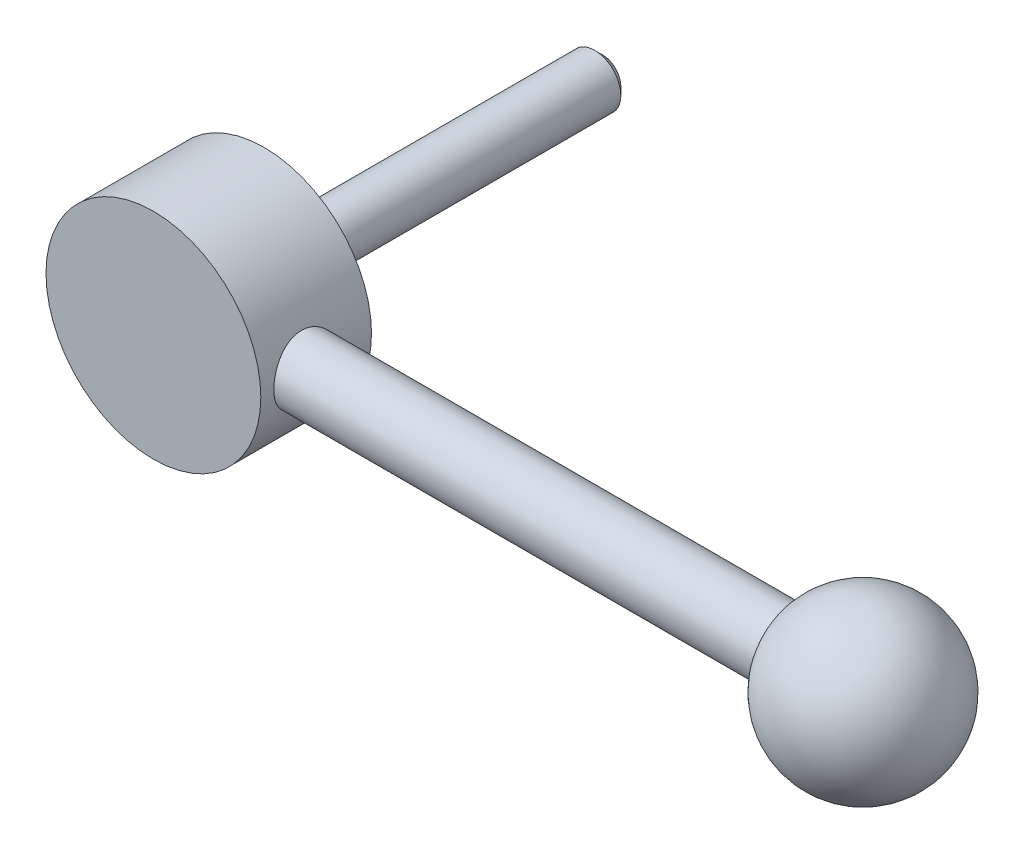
ISO-10303-21;
HEADER;
FILE_DESCRIPTION(('STEP AP214'),'2;1');
FILE_NAME('part.step','',(''),(''),'','','');
FILE_SCHEMA(('AUTOMOTIVE_DESIGN { 1 0 10303 214 1 1 1 1 }'));
ENDSEC;
DATA;
#1=APPLICATION_CONTEXT('core data for automotive mechanical design processes');
#2=APPLICATION_PROTOCOL_DEFINITION('international standard','automotive_design',2000,#1);
#3=PRODUCT_CONTEXT('',#1,'mechanical');
#4=PRODUCT('Part','Part','',(#3));
#5=PRODUCT_RELATED_PRODUCT_CATEGORY('part','',(#4));
#6=PRODUCT_DEFINITION_FORMATION('','',#4);
#7=PRODUCT_DEFINITION_CONTEXT('part definition',#1,'design');
#8=PRODUCT_DEFINITION('design','',#6,#7);
#9=PRODUCT_DEFINITION_SHAPE('','',#8);
#10=(LENGTH_UNIT() NAMED_UNIT(*) SI_UNIT(.MILLI.,.METRE.));
#11=(NAMED_UNIT(*) PLANE_ANGLE_UNIT() SI_UNIT($,.RADIAN.));
#12=(NAMED_UNIT(*) SI_UNIT($,.STERADIAN.) SOLID_ANGLE_UNIT());
#13=UNCERTAINTY_MEASURE_WITH_UNIT(LENGTH_MEASURE(1.E-05),#10,'distance_accuracy_value','');
#14=(GEOMETRIC_REPRESENTATION_CONTEXT(3) GLOBAL_UNCERTAINTY_ASSIGNED_CONTEXT((#13)) GLOBAL_UNIT_ASSIGNED_CONTEXT((#10,
#11,#12)) REPRESENTATION_CONTEXT('',''));
#15=CARTESIAN_POINT('',(0.,0.,0.));
#16=DIRECTION('',(0.,0.,1.));
#17=DIRECTION('',(1.,0.,0.));
#18=AXIS2_PLACEMENT_3D('',#15,#16,#17);
#19=CARTESIAN_POINT('',(0.,0.,40.));
#20=DIRECTION('',(0.,0.,1.));
#21=DIRECTION('',(1.,0.,0.));
#22=AXIS2_PLACEMENT_3D('',#19,#20,#21);
#23=CYLINDRICAL_SURFACE('',#22,6.75);
#24=CARTESIAN_POINT('',(0.,0.,2.));
#25=DIRECTION('',(0.,0.,1.));
#26=DIRECTION('',(1.,0.,0.));
#27=AXIS2_PLACEMENT_3D('',#24,#25,#26);
#28=CIRCLE('',#27,6.75);
#29=CARTESIAN_POINT('',(6.75,0.,2.));
#30=VERTEX_POINT('',#29);
#31=EDGE_CURVE('E23',#30,#30,#28,.T.);
#32=ORIENTED_EDGE('',*,*,#31,.F.);
#33=EDGE_LOOP('',(#32));
#34=FACE_BOUND('',#33,.T.);
#35=CARTESIAN_POINT('',(0.,0.,0.));
#36=DIRECTION('',(0.,0.,1.));
#37=DIRECTION('',(1.,0.,0.));
#38=AXIS2_PLACEMENT_3D('',#35,#36,#37);
#39=CIRCLE('',#38,6.75);
#40=CARTESIAN_POINT('',(6.75,0.,0.));
#41=VERTEX_POINT('',#40);
#42=EDGE_CURVE('E37',#41,#41,#39,.T.);
#43=ORIENTED_EDGE('',*,*,#42,.T.);
#44=EDGE_LOOP('',(#43));
#45=FACE_BOUND('',#44,.T.);
#46=ADVANCED_FACE('F12',(#34,#45),#23,.T.);
#47=CARTESIAN_POINT('',(6.75,0.,2.));
#48=DIRECTION('',(0.,0.,1.));
#49=DIRECTION('',(1.,0.,0.));
#50=AXIS2_PLACEMENT_3D('',#47,#48,#49);
#51=PLANE('',#50);
#52=CARTESIAN_POINT('',(0.,0.,2.));
#53=DIRECTION('',(0.,0.,1.));
#54=DIRECTION('',(1.,0.,0.));
#55=AXIS2_PLACEMENT_3D('',#52,#53,#54);
#56=CIRCLE('',#55,16.5);
#57=CARTESIAN_POINT('',(16.5,0.,2.));
#58=VERTEX_POINT('',#57);
#59=EDGE_CURVE('E27',#58,#58,#56,.T.);
#60=ORIENTED_EDGE('',*,*,#59,.F.);
#61=EDGE_LOOP('',(#60));
#62=FACE_BOUND('',#61,.T.);
#63=ORIENTED_EDGE('',*,*,#31,.T.);
#64=EDGE_LOOP('',(#63));
#65=FACE_BOUND('',#64,.T.);
#66=ADVANCED_FACE('F68',(#62,#65),#51,.F.);
#67=CARTESIAN_POINT('',(0.,0.,40.));
#68=DIRECTION('',(0.,0.,1.));
#69=DIRECTION('',(1.,0.,0.));
#70=AXIS2_PLACEMENT_3D('',#67,#68,#69);
#71=CYLINDRICAL_SURFACE('',#70,16.5);
#72=CARTESIAN_POINT('',(16.5,0.,7.));
#73=CARTESIAN_POINT('',(16.499997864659,-0.27416656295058,7.00000297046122));
#74=CARTESIAN_POINT('',(16.493101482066,-0.548363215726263,7.02262484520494));
#75=CARTESIAN_POINT('',(16.4662646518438,-1.08876356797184,7.11229452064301));
#76=CARTESIAN_POINT('',(16.446320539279,-1.35496499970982,7.17935480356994));
#77=CARTESIAN_POINT('',(16.3955720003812,-1.87150278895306,7.35545075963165));
#78=CARTESIAN_POINT('',(16.3647837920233,-2.12186218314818,7.4644237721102));
#79=CARTESIAN_POINT('',(16.2955420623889,-2.60075521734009,7.72099257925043));
#80=CARTESIAN_POINT('',(16.2570874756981,-2.82928581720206,7.86859374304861));
#81=CARTESIAN_POINT('',(16.1753529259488,-3.26471495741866,8.20277426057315));
#82=CARTESIAN_POINT('',(16.1319725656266,-3.47088543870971,8.39027763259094));
#83=CARTESIAN_POINT('',(16.0458704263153,-3.84938917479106,8.79697111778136));
#84=CARTESIAN_POINT('',(16.003148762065,-4.02171659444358,9.0161666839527));
#85=CARTESIAN_POINT('',(15.9221353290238,-4.33150150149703,9.48621682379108));
#86=CARTESIAN_POINT('',(15.8839681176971,-4.46806535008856,9.73768383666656));
#87=CARTESIAN_POINT('',(15.8178878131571,-4.69666762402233,10.2613575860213));
#88=CARTESIAN_POINT('',(15.7899722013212,-4.78871698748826,10.5335592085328));
#89=CARTESIAN_POINT('',(15.748602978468,-4.92304273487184,11.0827901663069));
#90=CARTESIAN_POINT('',(15.7347597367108,-4.96666335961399,11.3594605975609));
#91=CARTESIAN_POINT('',(15.7219440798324,-5.00709144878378,11.9165124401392));
#92=CARTESIAN_POINT('',(15.7229679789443,-5.00391051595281,12.1968929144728));
#93=CARTESIAN_POINT('',(15.7394259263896,-4.95188056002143,12.7424297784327));
#94=CARTESIAN_POINT('',(15.7543266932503,-4.90472150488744,13.0077661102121));
#95=CARTESIAN_POINT('',(15.7959958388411,-4.76880670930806,13.5265684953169));
#96=CARTESIAN_POINT('',(15.8227654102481,-4.68004678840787,13.7800333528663));
#97=CARTESIAN_POINT('',(15.8855774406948,-4.46221737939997,14.2720056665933));
#98=CARTESIAN_POINT('',(15.9217437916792,-4.33260397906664,14.5102558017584));
#99=CARTESIAN_POINT('',(15.9992154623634,-4.03712482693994,14.9621878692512));
#100=CARTESIAN_POINT('',(16.0405220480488,-3.87125013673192,15.1758637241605));
#101=CARTESIAN_POINT('',(16.125777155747,-3.49958783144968,15.5821595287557));
#102=CARTESIAN_POINT('',(16.1697632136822,-3.29239951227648,15.7734925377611));
#103=CARTESIAN_POINT('',(16.2538615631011,-2.84832978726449,16.1190003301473));
#104=CARTESIAN_POINT('',(16.2939736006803,-2.61144643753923,16.2731726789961));
#105=CARTESIAN_POINT('',(16.3661834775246,-2.11233821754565,16.540785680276));
#106=CARTESIAN_POINT('',(16.3982236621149,-1.84994861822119,16.6539357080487));
#107=CARTESIAN_POINT('',(16.4502641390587,-1.30866646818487,16.8341173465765));
#108=CARTESIAN_POINT('',(16.4702678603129,-1.02977864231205,16.9011620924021));
#109=CARTESIAN_POINT('',(16.4954369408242,-0.474353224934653,16.985075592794));
#110=CARTESIAN_POINT('',(16.5011177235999,-0.198102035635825,17.0036880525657));
#111=CARTESIAN_POINT('',(16.4985159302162,0.353597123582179,16.99510293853));
#112=CARTESIAN_POINT('',(16.4902352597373,0.629045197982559,16.9679116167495));
#113=CARTESIAN_POINT('',(16.4609787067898,1.16470330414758,16.869898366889));
#114=CARTESIAN_POINT('',(16.4403007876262,1.42511840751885,16.8000997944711));
#115=CARTESIAN_POINT('',(16.388649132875,1.93048096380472,16.6200887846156));
#116=CARTESIAN_POINT('',(16.3576741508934,2.17542653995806,16.5098714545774));
#117=CARTESIAN_POINT('',(16.2877277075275,2.64927766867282,16.2492534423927));
#118=CARTESIAN_POINT('',(16.2485858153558,2.87767261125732,16.097971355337));
#119=CARTESIAN_POINT('',(16.1667951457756,3.30642612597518,15.7605859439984));
#120=CARTESIAN_POINT('',(16.1241454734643,3.50677750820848,15.5744737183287));
#121=CARTESIAN_POINT('',(16.0381606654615,3.88146430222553,15.1645160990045));
#122=CARTESIAN_POINT('',(15.9948588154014,4.05455854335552,14.9395268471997));
#123=CARTESIAN_POINT('',(15.9141467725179,4.36062787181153,14.4627539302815));
#124=CARTESIAN_POINT('',(15.8767364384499,4.49360392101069,14.2109709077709));
#125=CARTESIAN_POINT('',(15.8124706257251,4.71477026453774,13.6884965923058));
#126=CARTESIAN_POINT('',(15.7855679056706,4.80316154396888,13.4178965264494));
#127=CARTESIAN_POINT('',(15.7455304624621,4.93284562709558,12.8646819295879));
#128=CARTESIAN_POINT('',(15.732390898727,4.97415499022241,12.5820716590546));
#129=CARTESIAN_POINT('',(15.7218509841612,5.00736143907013,12.0257720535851));
#130=CARTESIAN_POINT('',(15.7238051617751,5.00128483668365,11.7522143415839));
#131=CARTESIAN_POINT('',(15.7416767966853,4.94474176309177,11.2102140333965));
#132=CARTESIAN_POINT('',(15.7575936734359,4.89427713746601,10.9417712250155));
#133=CARTESIAN_POINT('',(15.8011599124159,4.75171037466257,10.4210074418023));
#134=CARTESIAN_POINT('',(15.8286548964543,4.66015510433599,10.1685228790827));
#135=CARTESIAN_POINT('',(15.8922482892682,4.43843275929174,9.68229661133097));
#136=CARTESIAN_POINT('',(15.9283483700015,4.30825817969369,9.44855856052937));
#137=CARTESIAN_POINT('',(16.0067548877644,4.00734203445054,8.99708364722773));
#138=CARTESIAN_POINT('',(16.0492418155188,3.83527527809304,8.78026142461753));
#139=CARTESIAN_POINT('',(16.1347696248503,3.45783157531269,8.3779118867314));
#140=CARTESIAN_POINT('',(16.1778106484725,3.25244592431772,8.19239277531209));
#141=CARTESIAN_POINT('',(16.2611473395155,2.80676565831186,7.85235596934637));
#142=CARTESIAN_POINT('',(16.301321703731,2.56560775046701,7.69893691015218));
#143=CARTESIAN_POINT('',(16.3729264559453,2.05970384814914,7.43503282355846));
#144=CARTESIAN_POINT('',(16.4043607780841,1.79496853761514,7.32452847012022));
#145=CARTESIAN_POINT('',(16.4523310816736,1.27725626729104,7.15905013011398));
#146=CARTESIAN_POINT('',(16.4700574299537,1.02582323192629,7.09957036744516));
#147=CARTESIAN_POINT('',(16.4938918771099,0.516268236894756,7.02004735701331));
#148=CARTESIAN_POINT('',(16.5000020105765,0.258147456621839,6.999997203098));
#149=CARTESIAN_POINT('',(16.5,0.,7.));
#150=B_SPLINE_CURVE_WITH_KNOTS('',3,(#72,#73,#74,#75,#76,#77,#78,#79,#80,#81,#82,#83,#84,#85,
#86,#87,#88,#89,#90,#91,#92,#93,#94,#95,#96,#97,#98,#99,#100,#101,#102,#103,#104,#105,#106,#107,
#108,#109,#110,#111,#112,#113,#114,#115,#116,#117,#118,#119,#120,#121,#122,#123,#124,#125,#126,
#127,#128,#129,#130,#131,#132,#133,#134,#135,#136,#137,#138,#139,#140,#141,#142,#143,#144,#145,
#146,#147,#148,#149),.UNSPECIFIED.,.T.,.F.,(4,2,2,2,2,2,2,2,2,2,2,2,2,2,2,2,2,2,2,2,2,2,2,2,2,2,
2,2,2,2,2,2,2,2,2,2,2,2,4),(0.,0.82155130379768,1.64333346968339,2.46389179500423,
3.28456423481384,4.12684629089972,4.96927344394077,5.83108565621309,6.69268599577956,
7.52972147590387,8.36654944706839,9.1724896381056,9.97851083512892,10.7957518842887,
11.6131946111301,12.4655059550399,13.3178731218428,14.1761660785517,15.0342144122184,
15.8609136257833,16.6875000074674,17.49497421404,18.302546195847,19.1290491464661,
19.9557636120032,20.8131534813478,21.6705227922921,22.5239918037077,23.3771605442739,
24.194052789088,25.0109110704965,25.8172062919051,26.6236583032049,27.4600121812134,
28.2965849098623,29.1582870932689,30.0196007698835,30.7932856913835,31.5668350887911),.UNSPECIFIED.);
#151=CARTESIAN_POINT('',(16.5,0.,7.));
#152=VERTEX_POINT('',#151);
#153=EDGE_CURVE('E30',#152,#152,#150,.T.);
#154=ORIENTED_EDGE('',*,*,#153,.T.);
#155=EDGE_LOOP('',(#154));
#156=FACE_BOUND('',#155,.T.);
#157=CARTESIAN_POINT('',(0.,0.,19.));
#158=DIRECTION('',(0.,0.,1.));
#159=DIRECTION('',(1.,0.,0.));
#160=AXIS2_PLACEMENT_3D('',#157,#158,#159);
#161=CIRCLE('',#160,16.5);
#162=CARTESIAN_POINT('',(16.5,0.,19.));
#163=VERTEX_POINT('',#162);
#164=EDGE_CURVE('E85',#163,#163,#161,.T.);
#165=ORIENTED_EDGE('',*,*,#164,.F.);
#166=EDGE_LOOP('',(#165));
#167=FACE_BOUND('',#166,.T.);
#168=ORIENTED_EDGE('',*,*,#59,.T.);
#169=EDGE_LOOP('',(#168));
#170=FACE_BOUND('',#169,.T.);
#171=ADVANCED_FACE('F40',(#156,#167,#170),#71,.T.);
#172=CARTESIAN_POINT('',(16.5,0.,19.));
#173=DIRECTION('',(0.,0.,-1.));
#174=DIRECTION('',(-1.,0.,0.));
#175=AXIS2_PLACEMENT_3D('',#172,#173,#174);
#176=PLANE('',#175);
#177=ORIENTED_EDGE('',*,*,#164,.T.);
#178=EDGE_LOOP('',(#177));
#179=FACE_BOUND('',#178,.T.);
#180=ADVANCED_FACE('F60',(#179),#176,.F.);
#181=CARTESIAN_POINT('',(4.,0.,-50.));
#182=DIRECTION('',(0.,0.,-1.));
#183=DIRECTION('',(-1.,0.,0.));
#184=AXIS2_PLACEMENT_3D('',#181,#182,#183);
#185=PLANE('',#184);
#186=CARTESIAN_POINT('',(0.,0.,-50.));
#187=DIRECTION('',(0.,0.,-1.));
#188=DIRECTION('',(-1.,0.,0.));
#189=AXIS2_PLACEMENT_3D('',#186,#187,#188);
#190=CIRCLE('',#189,2.8);
#191=CARTESIAN_POINT('',(-2.8,0.,-50.));
#192=VERTEX_POINT('',#191);
#193=EDGE_CURVE('E8',#192,#192,#190,.T.);
#194=ORIENTED_EDGE('',*,*,#193,.T.);
#195=EDGE_LOOP('',(#194));
#196=FACE_BOUND('',#195,.T.);
#197=ADVANCED_FACE('F58',(#196),#185,.T.);
#198=CARTESIAN_POINT('',(0.,0.,40.));
#199=DIRECTION('',(0.,0.,1.));
#200=DIRECTION('',(1.,0.,0.));
#201=AXIS2_PLACEMENT_3D('',#198,#199,#200);
#202=CYLINDRICAL_SURFACE('',#201,4.);
#203=CARTESIAN_POINT('',(0.,0.,-48.8));
#204=DIRECTION('',(0.,0.,-1.));
#205=DIRECTION('',(-1.,0.,0.));
#206=AXIS2_PLACEMENT_3D('',#203,#204,#205);
#207=CIRCLE('',#206,4.);
#208=CARTESIAN_POINT('',(-4.,0.,-48.8));
#209=VERTEX_POINT('',#208);
#210=EDGE_CURVE('E19',#209,#209,#207,.F.);
#211=ORIENTED_EDGE('',*,*,#210,.T.);
#212=EDGE_LOOP('',(#211));
#213=FACE_BOUND('',#212,.T.);
#214=CARTESIAN_POINT('',(0.,0.,0.));
#215=DIRECTION('',(0.,0.,1.));
#216=DIRECTION('',(1.,0.,0.));
#217=AXIS2_PLACEMENT_3D('',#214,#215,#216);
#218=CIRCLE('',#217,4.);
#219=CARTESIAN_POINT('',(4.,0.,0.));
#220=VERTEX_POINT('',#219);
#221=EDGE_CURVE('E82',#220,#220,#218,.T.);
#222=ORIENTED_EDGE('',*,*,#221,.F.);
#223=EDGE_LOOP('',(#222));
#224=FACE_BOUND('',#223,.T.);
#225=ADVANCED_FACE('F54',(#213,#224),#202,.T.);
#226=CARTESIAN_POINT('',(4.,0.,0.));
#227=DIRECTION('',(0.,0.,1.));
#228=DIRECTION('',(1.,0.,0.));
#229=AXIS2_PLACEMENT_3D('',#226,#227,#228);
#230=PLANE('',#229);
#231=ORIENTED_EDGE('',*,*,#42,.F.);
#232=EDGE_LOOP('',(#231));
#233=FACE_BOUND('',#232,.T.);
#234=ORIENTED_EDGE('',*,*,#221,.T.);
#235=EDGE_LOOP('',(#234));
#236=FACE_BOUND('',#235,.T.);
#237=ADVANCED_FACE('F50',(#233,#236),#230,.F.);
#238=CARTESIAN_POINT('',(-30.,0.,12.));
#239=DIRECTION('',(-1.,0.,0.));
#240=DIRECTION('',(0.,0.,1.));
#241=AXIS2_PLACEMENT_3D('',#238,#239,#240);
#242=CYLINDRICAL_SURFACE('',#241,5.);
#243=CARTESIAN_POINT('',(90.5435607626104,0.,12.));
#244=DIRECTION('',(-1.,0.,0.));
#245=DIRECTION('',(0.,0.,1.));
#246=AXIS2_PLACEMENT_3D('',#243,#244,#245);
#247=CIRCLE('',#246,5.);
#248=CARTESIAN_POINT('',(90.5435607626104,0.,17.));
#249=VERTEX_POINT('',#248);
#250=EDGE_CURVE('E38',#249,#249,#247,.T.);
#251=ORIENTED_EDGE('',*,*,#250,.T.);
#252=EDGE_LOOP('',(#251));
#253=FACE_BOUND('',#252,.T.);
#254=ORIENTED_EDGE('',*,*,#153,.F.);
#255=EDGE_LOOP('',(#254));
#256=FACE_BOUND('',#255,.T.);
#257=ADVANCED_FACE('F44',(#253,#256),#242,.T.);
#258=CARTESIAN_POINT('',(102.,0.,12.));
#259=DIRECTION('',(0.,0.,1.));
#260=DIRECTION('',(1.,0.,0.));
#261=AXIS2_PLACEMENT_3D('',#258,#259,#260);
#262=SPHERICAL_SURFACE('',#261,12.5);
#263=CARTESIAN_POINT('',(102.,0.,12.));
#264=DIRECTION('',(-1.,0.,0.));
#265=DIRECTION('',(0.,0.,1.));
#266=AXIS2_PLACEMENT_3D('',#263,#264,#265);
#267=SPHERICAL_SURFACE('',#266,12.5);
#268=ORIENTED_EDGE('',*,*,#250,.F.);
#269=EDGE_LOOP('',(#268));
#270=FACE_BOUND('',#269,.T.);
#271=ADVANCED_FACE('F49',(#270),#267,.T.);
#272=CARTESIAN_POINT('',(0.,0.,-48.8));
#273=DIRECTION('',(0.,0.,1.));
#274=DIRECTION('',(1.,0.,0.));
#275=AXIS2_PLACEMENT_3D('',#272,#273,#274);
#276=CONICAL_SURFACE('',#275,4.,0.785398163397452);
#277=ORIENTED_EDGE('',*,*,#193,.F.);
#278=EDGE_LOOP('',(#277));
#279=FACE_BOUND('',#278,.T.);
#280=ORIENTED_EDGE('',*,*,#210,.F.);
#281=EDGE_LOOP('',(#280));
#282=FACE_BOUND('',#281,.T.);
#283=ADVANCED_FACE('F14',(#279,#282),#276,.T.);
#284=CLOSED_SHELL('',(#46,#66,#171,#180,#197,#225,#237,#257,#271,#283));
#285=MANIFOLD_SOLID_BREP('B1',#284);
#286=ADVANCED_BREP_SHAPE_REPRESENTATION('',(#18,#285),#14);
#287=SHAPE_DEFINITION_REPRESENTATION(#9,#286);
ENDSEC;
END-ISO-10303-21;
